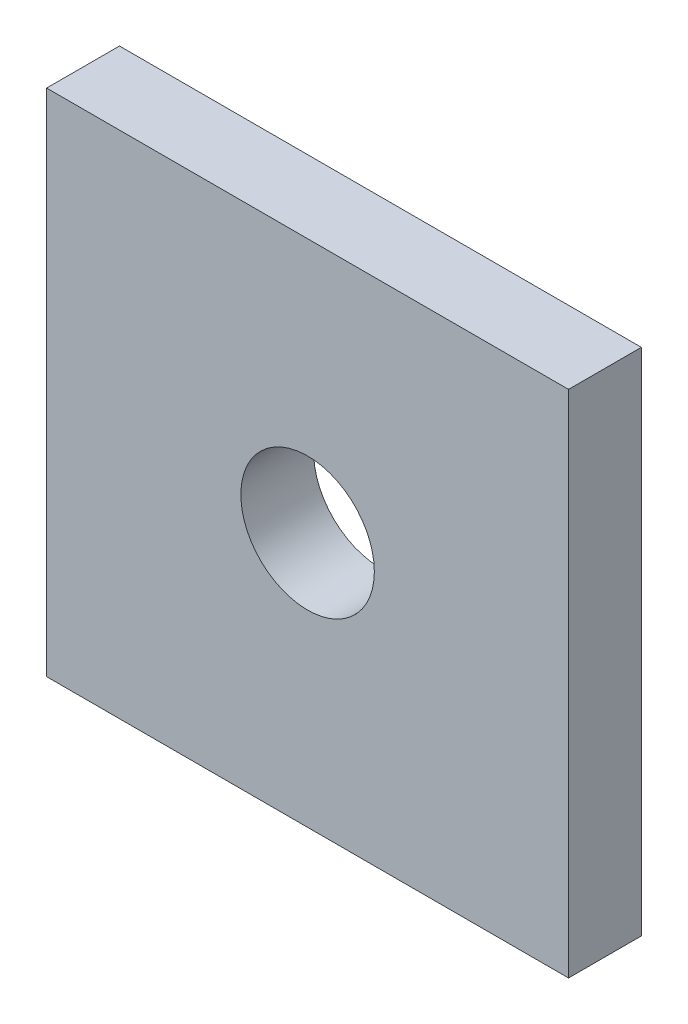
from build123d import *

# Parameters (mm, degrees)
SKETCH1_W           = 43
SKETCH1_H           = 42
SKETCH1_R           = 5.5
BOSS_EXTRUDE1_DEPTH = 6


with BuildPart() as part:
    # Sketch1 → Boss-Extrude1 (new body)
    with BuildSketch(Plane.XY):
        Rectangle(SKETCH1_W, SKETCH1_H)
        Circle(SKETCH1_R, mode=Mode.SUBTRACT)
    extrude(amount=BOSS_EXTRUDE1_DEPTH)


solid = part.part
